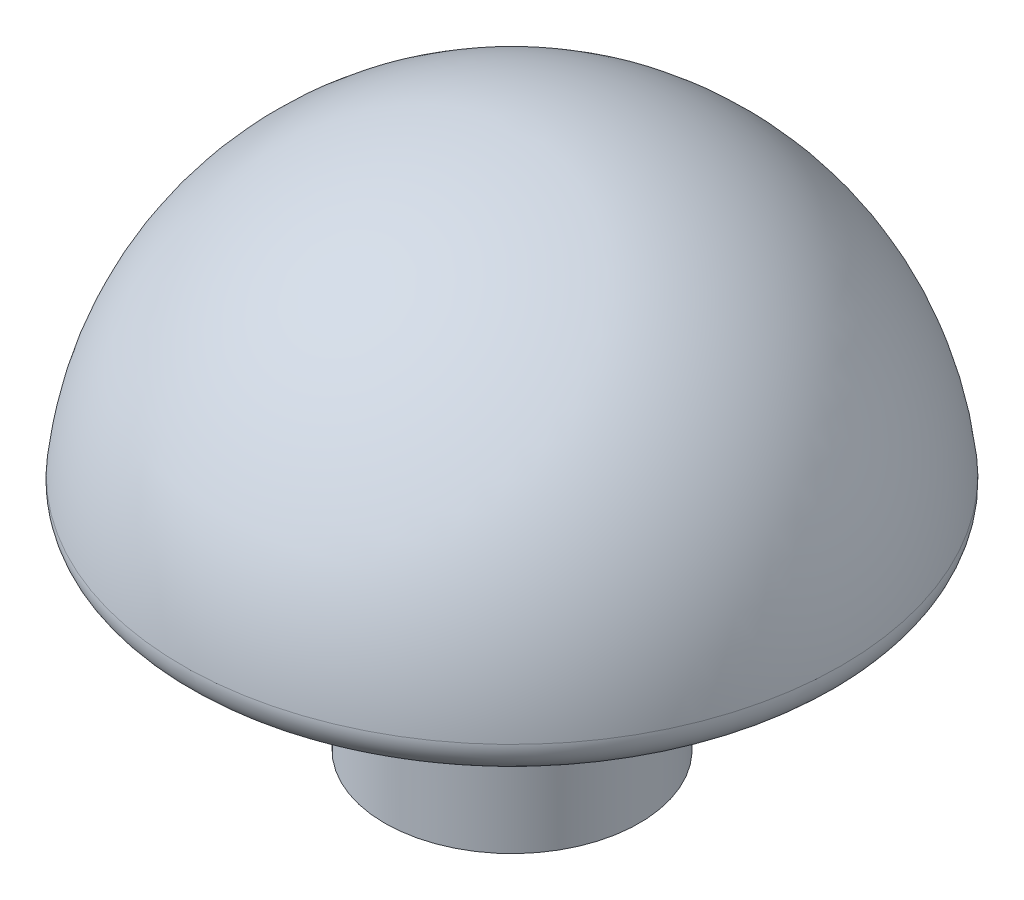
from build123d import *

# Parameters (mm, degrees)
SKETCH1_R      = 12.5
EXTRUDE1_DEPTH = 20
FILLET2_R      = 3


with BuildPart() as part:
    # Sketch1 → Extrude1 (new body)
    with BuildSketch(Plane(origin=(0, 0, 0), x_dir=(1, 0, 0), z_dir=(0, 1, 0))):
        with Locations(Location((0, 0, 0), (0, 0, 270))):
            Circle(SKETCH1_R)
        with BuildLine():
            Line((4.5, 6), (4.5, -6))
            ThreePointArc((4.5, -6), (-7.5, 0), (4.5, 6))
        make_face(mode=Mode.SUBTRACT)
    extrude(amount=EXTRUDE1_DEPTH)

    # Sketch3 → Revolve1 (revolve)
    with BuildSketch(Plane.XY):
        with BuildLine():
            Line((32.5, 20), (0, 20))
            Line((0, 20), (0, 52.5))
            ThreePointArc((0, 52.5), (22.980970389, 42.980970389), (32.5, 20))
        make_face()
    revolve(axis=Axis((0, 20, 0), (0, 1, 0)))

    # Fillet2
    fillet2_edges = [part.edges().sort_by_distance(p)[0] for p in [
        (-32.5, 20, 0),
        (0, 20, -12.5),
    ]]
    fillet(fillet2_edges, radius=FILLET2_R)


solid = part.part
